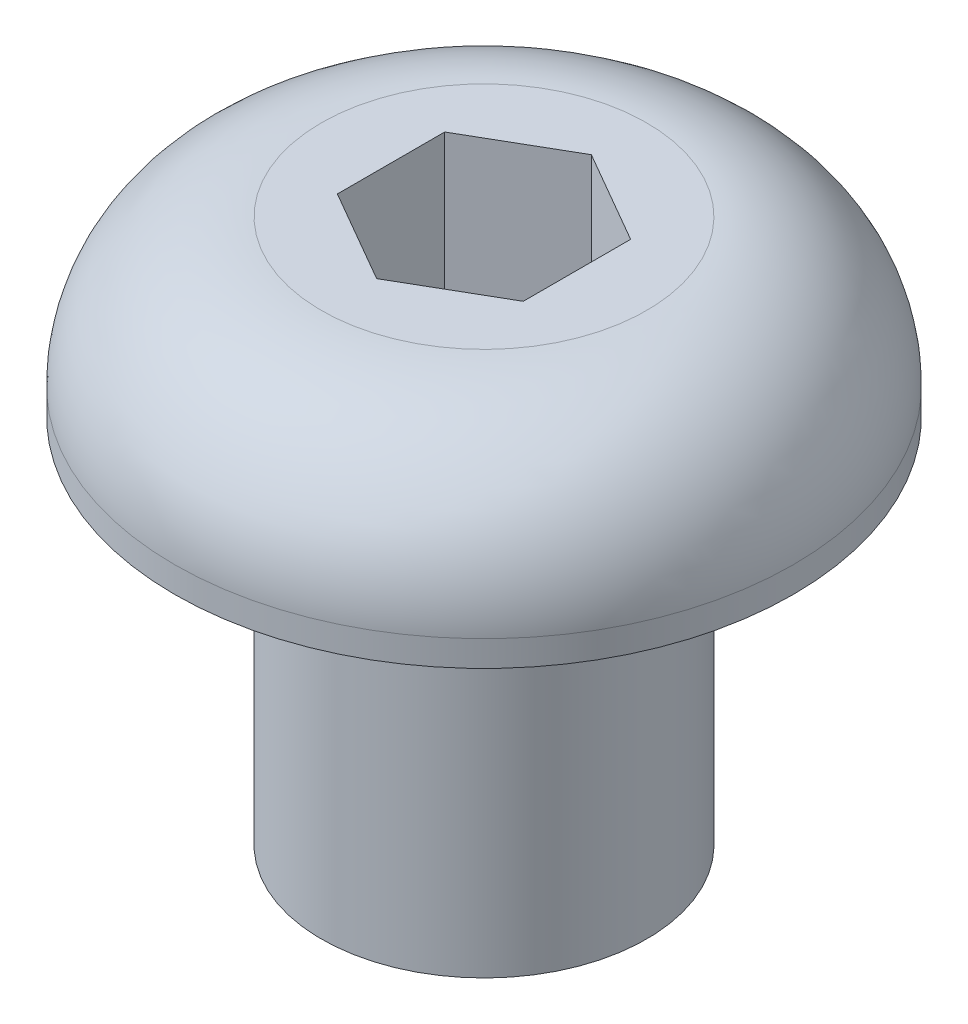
ISO-10303-21;
HEADER;
FILE_DESCRIPTION(('STEP AP214'),'2;1');
FILE_NAME('part.step','',(''),(''),'','','');
FILE_SCHEMA(('AUTOMOTIVE_DESIGN { 1 0 10303 214 1 1 1 1 }'));
ENDSEC;
DATA;
#1=APPLICATION_CONTEXT('core data for automotive mechanical design processes');
#2=APPLICATION_PROTOCOL_DEFINITION('international standard','automotive_design',2000,#1);
#3=PRODUCT_CONTEXT('',#1,'mechanical');
#4=PRODUCT('Part','Part','',(#3));
#5=PRODUCT_RELATED_PRODUCT_CATEGORY('part','',(#4));
#6=PRODUCT_DEFINITION_FORMATION('','',#4);
#7=PRODUCT_DEFINITION_CONTEXT('part definition',#1,'design');
#8=PRODUCT_DEFINITION('design','',#6,#7);
#9=PRODUCT_DEFINITION_SHAPE('','',#8);
#10=(LENGTH_UNIT() NAMED_UNIT(*) SI_UNIT(.MILLI.,.METRE.));
#11=(NAMED_UNIT(*) PLANE_ANGLE_UNIT() SI_UNIT($,.RADIAN.));
#12=(NAMED_UNIT(*) SI_UNIT($,.STERADIAN.) SOLID_ANGLE_UNIT());
#13=UNCERTAINTY_MEASURE_WITH_UNIT(LENGTH_MEASURE(1.E-05),#10,'distance_accuracy_value','');
#14=(GEOMETRIC_REPRESENTATION_CONTEXT(3) GLOBAL_UNCERTAINTY_ASSIGNED_CONTEXT((#13)) GLOBAL_UNIT_ASSIGNED_CONTEXT((#10,
#11,#12)) REPRESENTATION_CONTEXT('',''));
#15=CARTESIAN_POINT('',(0.,0.,0.));
#16=DIRECTION('',(0.,0.,1.));
#17=DIRECTION('',(1.,0.,0.));
#18=AXIS2_PLACEMENT_3D('',#15,#16,#17);
#19=CARTESIAN_POINT('',(1.77635683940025E-12,-6.97229999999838,-8.88178419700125E-13));
#20=DIRECTION('',(0.,1.,0.));
#21=DIRECTION('',(-1.00000000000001,0.,0.));
#22=AXIS2_PLACEMENT_3D('',#19,#20,#21);
#23=PLANE('',#22);
#24=CARTESIAN_POINT('',(1.77635683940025E-12,-6.97229999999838,-8.88178419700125E-13));
#25=DIRECTION('',(0.,1.,0.));
#26=DIRECTION('',(-1.00000000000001,0.,0.));
#27=AXIS2_PLACEMENT_3D('',#24,#25,#26);
#28=CIRCLE('',#27,2.0828);
#29=CARTESIAN_POINT('',(-2.08279999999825,-6.97229999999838,-8.92991044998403E-13));
#30=VERTEX_POINT('',#29);
#31=EDGE_CURVE('E11',#30,#30,#28,.T.);
#32=ORIENTED_EDGE('',*,*,#31,.F.);
#33=EDGE_LOOP('',(#32));
#34=FACE_BOUND('',#33,.T.);
#35=ADVANCED_FACE('F38',(#34),#23,.F.);
#36=CARTESIAN_POINT('',(0.,0.,0.));
#37=DIRECTION('',(0.,1.,0.));
#38=DIRECTION('',(-1.00000000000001,0.,0.));
#39=AXIS2_PLACEMENT_3D('',#36,#37,#38);
#40=CYLINDRICAL_SURFACE('',#39,2.0828);
#41=CARTESIAN_POINT('',(1.77635683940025E-12,-2.20980000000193,3.33066907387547E-13));
#42=DIRECTION('',(0.,1.,0.));
#43=DIRECTION('',(-1.00000000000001,0.,0.));
#44=AXIS2_PLACEMENT_3D('',#41,#42,#43);
#45=CIRCLE('',#44,2.0828);
#46=CARTESIAN_POINT('',(-2.08279999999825,-2.20980000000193,3.28254282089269E-13));
#47=VERTEX_POINT('',#46);
#48=EDGE_CURVE('E45',#47,#47,#45,.T.);
#49=ORIENTED_EDGE('',*,*,#48,.F.);
#50=EDGE_LOOP('',(#49));
#51=FACE_BOUND('',#50,.T.);
#52=ORIENTED_EDGE('',*,*,#31,.T.);
#53=EDGE_LOOP('',(#52));
#54=FACE_BOUND('',#53,.T.);
#55=ADVANCED_FACE('F157',(#51,#54),#40,.T.);
#56=CARTESIAN_POINT('',(2.08280000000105,-2.20980000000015,4.44089209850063E-13));
#57=DIRECTION('',(0.,1.,0.));
#58=DIRECTION('',(-1.00000000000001,0.,0.));
#59=AXIS2_PLACEMENT_3D('',#56,#57,#58);
#60=PLANE('',#59);
#61=CARTESIAN_POINT('',(1.77635683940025E-12,-2.20980000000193,3.33066907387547E-13));
#62=DIRECTION('',(0.,1.,0.));
#63=DIRECTION('',(-1.00000000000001,0.,0.));
#64=AXIS2_PLACEMENT_3D('',#61,#62,#63);
#65=CIRCLE('',#64,3.9624);
#66=CARTESIAN_POINT('',(-3.96239999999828,-2.20980000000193,3.23911181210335E-13));
#67=VERTEX_POINT('',#66);
#68=EDGE_CURVE('E150',#67,#67,#65,.T.);
#69=ORIENTED_EDGE('',*,*,#68,.F.);
#70=EDGE_LOOP('',(#69));
#71=FACE_BOUND('',#70,.T.);
#72=ORIENTED_EDGE('',*,*,#48,.T.);
#73=EDGE_LOOP('',(#72));
#74=FACE_BOUND('',#73,.T.);
#75=ADVANCED_FACE('F155',(#71,#74),#60,.F.);
#76=CARTESIAN_POINT('',(0.,0.,0.));
#77=DIRECTION('',(0.,1.,0.));
#78=DIRECTION('',(-1.00000000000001,0.,0.));
#79=AXIS2_PLACEMENT_3D('',#76,#77,#78);
#80=CYLINDRICAL_SURFACE('',#79,3.9624);
#81=CARTESIAN_POINT('',(0.,-1.87959999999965,-4.44089209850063E-13));
#82=DIRECTION('',(0.,1.,0.));
#83=DIRECTION('',(-1.00000000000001,0.,0.));
#84=AXIS2_PLACEMENT_3D('',#81,#82,#83);
#85=CIRCLE('',#84,3.9624);
#86=CARTESIAN_POINT('',(-3.96240000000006,-1.87959999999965,-4.53244936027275E-13));
#87=VERTEX_POINT('',#86);
#88=EDGE_CURVE('E147',#87,#87,#85,.T.);
#89=ORIENTED_EDGE('',*,*,#88,.F.);
#90=EDGE_LOOP('',(#89));
#91=FACE_BOUND('',#90,.T.);
#92=ORIENTED_EDGE('',*,*,#68,.T.);
#93=EDGE_LOOP('',(#92));
#94=FACE_BOUND('',#93,.T.);
#95=ADVANCED_FACE('F175',(#91,#94),#80,.T.);
#96=CARTESIAN_POINT('',(0.,-1.87959999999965,-4.44089209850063E-13));
#97=DIRECTION('',(0.,1.,0.));
#98=DIRECTION('',(-1.00000000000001,0.,0.));
#99=AXIS2_PLACEMENT_3D('',#96,#97,#98);
#100=TOROIDAL_SURFACE('',#99,2.0828,1.8796);
#101=CARTESIAN_POINT('',(0.,0.,0.));
#102=DIRECTION('',(0.,1.,0.));
#103=DIRECTION('',(-1.00000000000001,0.,0.));
#104=AXIS2_PLACEMENT_3D('',#101,#102,#103);
#105=CIRCLE('',#104,2.0828);
#106=CARTESIAN_POINT('',(-2.08280000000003,0.,0.));
#107=VERTEX_POINT('',#106);
#108=EDGE_CURVE('E139',#107,#107,#105,.T.);
#109=ORIENTED_EDGE('',*,*,#108,.F.);
#110=EDGE_LOOP('',(#109));
#111=FACE_BOUND('',#110,.T.);
#112=ORIENTED_EDGE('',*,*,#88,.T.);
#113=EDGE_LOOP('',(#112));
#114=FACE_BOUND('',#113,.T.);
#115=ADVANCED_FACE('F183',(#111,#114),#100,.T.);
#116=CARTESIAN_POINT('',(2.08279999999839,-8.88178419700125E-13,-4.44089209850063E-13));
#117=DIRECTION('',(0.,-1.,0.));
#118=DIRECTION('',(1.00000000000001,0.,0.));
#119=AXIS2_PLACEMENT_3D('',#116,#117,#118);
#120=PLANE('',#119);
#121=DIRECTION('',(-0.866025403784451,0.,0.500000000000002));
#122=VECTOR('',#121,1.);
#123=CARTESIAN_POINT('',(1.77635683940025E-12,-8.88178419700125E-13,-1.37481532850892));
#124=LINE('',#123,#122);
#125=CARTESIAN_POINT('',(1.77635683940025E-12,-8.88178419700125E-13,-1.37481532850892));
#126=VERTEX_POINT('',#125);
#127=CARTESIAN_POINT('',(-1.19062499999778,-2.66453525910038E-12,-0.687407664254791));
#128=VERTEX_POINT('',#127);
#129=EDGE_CURVE('E126',#126,#128,#124,.T.);
#130=ORIENTED_EDGE('',*,*,#129,.F.);
#131=DIRECTION('',(-0.866025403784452,0.,-0.500000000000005));
#132=VECTOR('',#131,1.);
#133=CARTESIAN_POINT('',(1.19062499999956,-8.88178419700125E-13,-0.687407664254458));
#134=LINE('',#133,#132);
#135=CARTESIAN_POINT('',(1.19062499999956,-8.88178419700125E-13,-0.687407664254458));
#136=VERTEX_POINT('',#135);
#137=EDGE_CURVE('E52',#136,#126,#134,.T.);
#138=ORIENTED_EDGE('',*,*,#137,.F.);
#139=DIRECTION('',(0.,0.,-1.00000000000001));
#140=VECTOR('',#139,1.);
#141=CARTESIAN_POINT('',(1.19062500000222,2.66453525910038E-12,0.687407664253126));
#142=LINE('',#141,#140);
#143=CARTESIAN_POINT('',(1.19062500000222,2.66453525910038E-12,0.687407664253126));
#144=VERTEX_POINT('',#143);
#145=EDGE_CURVE('E135',#144,#136,#142,.T.);
#146=ORIENTED_EDGE('',*,*,#145,.F.);
#147=DIRECTION('',(0.866025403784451,0.,-0.500000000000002));
#148=VECTOR('',#147,1.);
#149=CARTESIAN_POINT('',(0.,8.88178419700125E-13,1.37481532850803));
#150=LINE('',#149,#148);
#151=CARTESIAN_POINT('',(0.,8.88178419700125E-13,1.37481532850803));
#152=VERTEX_POINT('',#151);
#153=EDGE_CURVE('E133',#152,#144,#150,.T.);
#154=ORIENTED_EDGE('',*,*,#153,.F.);
#155=DIRECTION('',(0.866025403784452,0.,0.500000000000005));
#156=VECTOR('',#155,1.);
#157=CARTESIAN_POINT('',(-1.19062499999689,-8.88178419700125E-13,0.687407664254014));
#158=LINE('',#157,#156);
#159=CARTESIAN_POINT('',(-1.19062499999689,-8.88178419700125E-13,0.687407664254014));
#160=VERTEX_POINT('',#159);
#161=EDGE_CURVE('E100',#160,#152,#158,.T.);
#162=ORIENTED_EDGE('',*,*,#161,.F.);
#163=DIRECTION('',(0.,0.,1.00000000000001));
#164=VECTOR('',#163,1.);
#165=CARTESIAN_POINT('',(-1.19062499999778,-2.66453525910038E-12,-0.687407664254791));
#166=LINE('',#165,#164);
#167=EDGE_CURVE('E129',#128,#160,#166,.T.);
#168=ORIENTED_EDGE('',*,*,#167,.F.);
#169=EDGE_LOOP('',(#130,#138,#146,#154,#162,#168));
#170=FACE_BOUND('',#169,.T.);
#171=ORIENTED_EDGE('',*,*,#108,.T.);
#172=EDGE_LOOP('',(#171));
#173=FACE_BOUND('',#172,.T.);
#174=ADVANCED_FACE('F191',(#170,#173),#120,.F.);
#175=CARTESIAN_POINT('',(1.19062499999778,-2.53999999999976,-0.687407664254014));
#176=DIRECTION('',(0.500000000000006,0.,-0.866025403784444));
#177=DIRECTION('',(-0.866025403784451,0.,-0.500000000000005));
#178=AXIS2_PLACEMENT_3D('',#175,#176,#177);
#179=PLANE('',#178);
#180=ORIENTED_EDGE('',*,*,#137,.T.);
#181=DIRECTION('',(0.,1.,0.));
#182=VECTOR('',#181,1.);
#183=CARTESIAN_POINT('',(8.88178419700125E-13,-2.53999999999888,-1.37481532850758));
#184=LINE('',#183,#182);
#185=CARTESIAN_POINT('',(8.88178419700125E-13,-2.53999999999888,-1.37481532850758));
#186=VERTEX_POINT('',#185);
#187=EDGE_CURVE('E82',#186,#126,#184,.T.);
#188=ORIENTED_EDGE('',*,*,#187,.F.);
#189=DIRECTION('',(-0.866025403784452,0.,-0.500000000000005));
#190=VECTOR('',#189,1.);
#191=CARTESIAN_POINT('',(1.19062499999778,-2.53999999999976,-0.687407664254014));
#192=LINE('',#191,#190);
#193=CARTESIAN_POINT('',(1.19062499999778,-2.53999999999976,-0.687407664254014));
#194=VERTEX_POINT('',#193);
#195=EDGE_CURVE('E137',#194,#186,#192,.T.);
#196=ORIENTED_EDGE('',*,*,#195,.F.);
#197=DIRECTION('',(0.,1.,0.));
#198=VECTOR('',#197,1.);
#199=CARTESIAN_POINT('',(1.19062499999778,-2.53999999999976,-0.687407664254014));
#200=LINE('',#199,#198);
#201=EDGE_CURVE('E60',#194,#136,#200,.T.);
#202=ORIENTED_EDGE('',*,*,#201,.T.);
#203=EDGE_LOOP('',(#180,#188,#196,#202));
#204=FACE_BOUND('',#203,.T.);
#205=ADVANCED_FACE('F199',(#204),#179,.F.);
#206=CARTESIAN_POINT('',(1.19062499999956,-2.53999999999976,0.687407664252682));
#207=DIRECTION('',(1.00000000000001,0.,0.));
#208=DIRECTION('',(0.,1.,0.));
#209=AXIS2_PLACEMENT_3D('',#206,#207,#208);
#210=PLANE('',#209);
#211=ORIENTED_EDGE('',*,*,#145,.T.);
#212=ORIENTED_EDGE('',*,*,#201,.F.);
#213=DIRECTION('',(0.,0.,-1.00000000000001));
#214=VECTOR('',#213,1.);
#215=CARTESIAN_POINT('',(1.19062499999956,-2.53999999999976,0.687407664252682));
#216=LINE('',#215,#214);
#217=CARTESIAN_POINT('',(1.19062499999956,-2.53999999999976,0.687407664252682));
#218=VERTEX_POINT('',#217);
#219=EDGE_CURVE('E112',#218,#194,#216,.T.);
#220=ORIENTED_EDGE('',*,*,#219,.F.);
#221=DIRECTION('',(0.,1.,0.));
#222=VECTOR('',#221,1.);
#223=CARTESIAN_POINT('',(1.19062499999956,-2.53999999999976,0.687407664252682));
#224=LINE('',#223,#222);
#225=EDGE_CURVE('E104',#218,#144,#224,.T.);
#226=ORIENTED_EDGE('',*,*,#225,.T.);
#227=EDGE_LOOP('',(#211,#212,#220,#226));
#228=FACE_BOUND('',#227,.T.);
#229=ADVANCED_FACE('F207',(#228),#210,.F.);
#230=CARTESIAN_POINT('',(5.32907051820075E-12,-2.53999999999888,1.37481532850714));
#231=DIRECTION('',(0.500000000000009,0.,0.866025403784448));
#232=DIRECTION('',(0.866025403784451,0.,-0.500000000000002));
#233=AXIS2_PLACEMENT_3D('',#230,#231,#232);
#234=PLANE('',#233);
#235=ORIENTED_EDGE('',*,*,#153,.T.);
#236=ORIENTED_EDGE('',*,*,#225,.F.);
#237=DIRECTION('',(0.866025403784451,0.,-0.500000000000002));
#238=VECTOR('',#237,1.);
#239=CARTESIAN_POINT('',(5.32907051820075E-12,-2.53999999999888,1.37481532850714));
#240=LINE('',#239,#238);
#241=CARTESIAN_POINT('',(5.32907051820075E-12,-2.53999999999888,1.37481532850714));
#242=VERTEX_POINT('',#241);
#243=EDGE_CURVE('E108',#242,#218,#240,.T.);
#244=ORIENTED_EDGE('',*,*,#243,.F.);
#245=DIRECTION('',(0.,1.,0.));
#246=VECTOR('',#245,1.);
#247=CARTESIAN_POINT('',(5.32907051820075E-12,-2.53999999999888,1.37481532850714));
#248=LINE('',#247,#246);
#249=EDGE_CURVE('E93',#242,#152,#248,.T.);
#250=ORIENTED_EDGE('',*,*,#249,.T.);
#251=EDGE_LOOP('',(#235,#236,#244,#250));
#252=FACE_BOUND('',#251,.T.);
#253=ADVANCED_FACE('F109',(#252),#234,.F.);
#254=CARTESIAN_POINT('',(-1.19062499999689,-2.53999999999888,0.687407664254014));
#255=DIRECTION('',(-0.500000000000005,0.,0.866025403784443));
#256=DIRECTION('',(0.866025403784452,0.,0.500000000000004));
#257=AXIS2_PLACEMENT_3D('',#254,#255,#256);
#258=PLANE('',#257);
#259=ORIENTED_EDGE('',*,*,#161,.T.);
#260=ORIENTED_EDGE('',*,*,#249,.F.);
#261=DIRECTION('',(0.866025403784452,0.,0.500000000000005));
#262=VECTOR('',#261,1.);
#263=CARTESIAN_POINT('',(-1.19062499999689,-2.53999999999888,0.687407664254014));
#264=LINE('',#263,#262);
#265=CARTESIAN_POINT('',(-1.19062499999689,-2.53999999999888,0.687407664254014));
#266=VERTEX_POINT('',#265);
#267=EDGE_CURVE('E97',#266,#242,#264,.T.);
#268=ORIENTED_EDGE('',*,*,#267,.F.);
#269=DIRECTION('',(0.,1.,0.));
#270=VECTOR('',#269,1.);
#271=CARTESIAN_POINT('',(-1.19062499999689,-2.53999999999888,0.687407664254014));
#272=LINE('',#271,#270);
#273=EDGE_CURVE('E105',#266,#160,#272,.T.);
#274=ORIENTED_EDGE('',*,*,#273,.T.);
#275=EDGE_LOOP('',(#259,#260,#268,#274));
#276=FACE_BOUND('',#275,.T.);
#277=ADVANCED_FACE('F95',(#276),#258,.F.);
#278=CARTESIAN_POINT('',(-1.19062499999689,-2.54000000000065,-0.687407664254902));
#279=DIRECTION('',(-1.00000000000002,0.,0.));
#280=DIRECTION('',(0.,0.,1.00000000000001));
#281=AXIS2_PLACEMENT_3D('',#278,#279,#280);
#282=PLANE('',#281);
#283=ORIENTED_EDGE('',*,*,#167,.T.);
#284=ORIENTED_EDGE('',*,*,#273,.F.);
#285=DIRECTION('',(0.,0.,1.00000000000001));
#286=VECTOR('',#285,1.);
#287=CARTESIAN_POINT('',(-1.19062499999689,-2.54000000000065,-0.687407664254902));
#288=LINE('',#287,#286);
#289=CARTESIAN_POINT('',(-1.19062499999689,-2.54000000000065,-0.687407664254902));
#290=VERTEX_POINT('',#289);
#291=EDGE_CURVE('E118',#290,#266,#288,.T.);
#292=ORIENTED_EDGE('',*,*,#291,.F.);
#293=DIRECTION('',(0.,1.,0.));
#294=VECTOR('',#293,1.);
#295=CARTESIAN_POINT('',(-1.19062499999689,-2.54000000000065,-0.687407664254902));
#296=LINE('',#295,#294);
#297=EDGE_CURVE('E142',#290,#128,#296,.T.);
#298=ORIENTED_EDGE('',*,*,#297,.T.);
#299=EDGE_LOOP('',(#283,#284,#292,#298));
#300=FACE_BOUND('',#299,.T.);
#301=ADVANCED_FACE('F226',(#300),#282,.F.);
#302=CARTESIAN_POINT('',(8.88178419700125E-13,-2.53999999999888,-1.37481532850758));
#303=DIRECTION('',(-0.50000000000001,0.,-0.866025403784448));
#304=DIRECTION('',(-0.866025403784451,0.,0.500000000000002));
#305=AXIS2_PLACEMENT_3D('',#302,#303,#304);
#306=PLANE('',#305);
#307=ORIENTED_EDGE('',*,*,#129,.T.);
#308=ORIENTED_EDGE('',*,*,#297,.F.);
#309=DIRECTION('',(-0.866025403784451,0.,0.500000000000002));
#310=VECTOR('',#309,1.);
#311=CARTESIAN_POINT('',(8.88178419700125E-13,-2.53999999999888,-1.37481532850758));
#312=LINE('',#311,#310);
#313=EDGE_CURVE('E120',#186,#290,#312,.T.);
#314=ORIENTED_EDGE('',*,*,#313,.F.);
#315=ORIENTED_EDGE('',*,*,#187,.T.);
#316=EDGE_LOOP('',(#307,#308,#314,#315));
#317=FACE_BOUND('',#316,.T.);
#318=ADVANCED_FACE('F233',(#317),#306,.F.);
#319=CARTESIAN_POINT('',(8.88178419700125E-13,-2.53999999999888,-1.37481532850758));
#320=DIRECTION('',(0.,1.,0.));
#321=DIRECTION('',(-1.00000000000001,0.,0.));
#322=AXIS2_PLACEMENT_3D('',#319,#320,#321);
#323=PLANE('',#322);
#324=ORIENTED_EDGE('',*,*,#195,.T.);
#325=ORIENTED_EDGE('',*,*,#313,.T.);
#326=ORIENTED_EDGE('',*,*,#291,.T.);
#327=ORIENTED_EDGE('',*,*,#267,.T.);
#328=ORIENTED_EDGE('',*,*,#243,.T.);
#329=ORIENTED_EDGE('',*,*,#219,.T.);
#330=EDGE_LOOP('',(#324,#325,#326,#327,#328,#329));
#331=FACE_BOUND('',#330,.T.);
#332=ADVANCED_FACE('F115',(#331),#323,.T.);
#333=CLOSED_SHELL('',(#35,#55,#75,#95,#115,#174,#205,#229,#253,#277,#301,#318,#332));
#334=MANIFOLD_SOLID_BREP('B2',#333);
#335=ADVANCED_BREP_SHAPE_REPRESENTATION('',(#18,#334),#14);
#336=SHAPE_DEFINITION_REPRESENTATION(#9,#335);
ENDSEC;
END-ISO-10303-21;
